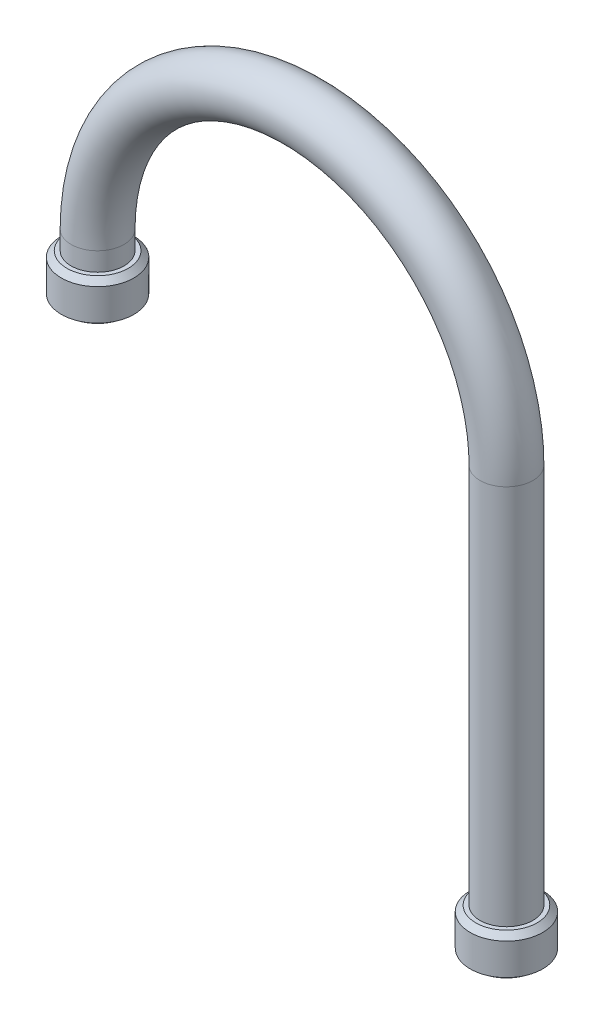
ISO-10303-21;
HEADER;
FILE_DESCRIPTION(('STEP AP214'),'2;1');
FILE_NAME('part.step','',(''),(''),'','','');
FILE_SCHEMA(('AUTOMOTIVE_DESIGN { 1 0 10303 214 1 1 1 1 }'));
ENDSEC;
DATA;
#1=APPLICATION_CONTEXT('core data for automotive mechanical design processes');
#2=APPLICATION_PROTOCOL_DEFINITION('international standard','automotive_design',2000,#1);
#3=PRODUCT_CONTEXT('',#1,'mechanical');
#4=PRODUCT('Part','Part','',(#3));
#5=PRODUCT_RELATED_PRODUCT_CATEGORY('part','',(#4));
#6=PRODUCT_DEFINITION_FORMATION('','',#4);
#7=PRODUCT_DEFINITION_CONTEXT('part definition',#1,'design');
#8=PRODUCT_DEFINITION('design','',#6,#7);
#9=PRODUCT_DEFINITION_SHAPE('','',#8);
#10=(LENGTH_UNIT() NAMED_UNIT(*) SI_UNIT(.MILLI.,.METRE.));
#11=(NAMED_UNIT(*) PLANE_ANGLE_UNIT() SI_UNIT($,.RADIAN.));
#12=(NAMED_UNIT(*) SI_UNIT($,.STERADIAN.) SOLID_ANGLE_UNIT());
#13=UNCERTAINTY_MEASURE_WITH_UNIT(LENGTH_MEASURE(1.E-05),#10,'distance_accuracy_value','');
#14=(GEOMETRIC_REPRESENTATION_CONTEXT(3) GLOBAL_UNCERTAINTY_ASSIGNED_CONTEXT((#13)) GLOBAL_UNIT_ASSIGNED_CONTEXT((#10,
#11,#12)) REPRESENTATION_CONTEXT('',''));
#15=CARTESIAN_POINT('',(0.,0.,0.));
#16=DIRECTION('',(0.,0.,1.));
#17=DIRECTION('',(1.,0.,0.));
#18=AXIS2_PLACEMENT_3D('',#15,#16,#17);
#19=CARTESIAN_POINT('',(0.,-2.,0.));
#20=DIRECTION('',(0.,-1.,0.));
#21=DIRECTION('',(0.,0.,-1.));
#22=AXIS2_PLACEMENT_3D('',#19,#20,#21);
#23=CYLINDRICAL_SURFACE('',#22,14.25);
#24=CARTESIAN_POINT('',(0.,20.,0.));
#25=DIRECTION('',(0.,-1.,0.));
#26=DIRECTION('',(0.,0.,-1.));
#27=AXIS2_PLACEMENT_3D('',#24,#25,#26);
#28=CIRCLE('',#27,14.25);
#29=CARTESIAN_POINT('',(0.,20.,-14.25));
#30=VERTEX_POINT('',#29);
#31=EDGE_CURVE('E26',#30,#30,#28,.T.);
#32=ORIENTED_EDGE('',*,*,#31,.F.);
#33=EDGE_LOOP('',(#32));
#34=FACE_BOUND('',#33,.T.);
#35=CARTESIAN_POINT('',(0.,30.,0.));
#36=DIRECTION('',(0.,-1.,0.));
#37=DIRECTION('',(0.,0.,-1.));
#38=AXIS2_PLACEMENT_3D('',#35,#36,#37);
#39=CIRCLE('',#38,14.25);
#40=CARTESIAN_POINT('',(0.,30.,-14.25));
#41=VERTEX_POINT('',#40);
#42=EDGE_CURVE('E10',#41,#41,#39,.T.);
#43=ORIENTED_EDGE('',*,*,#42,.T.);
#44=EDGE_LOOP('',(#43));
#45=FACE_BOUND('',#44,.T.);
#46=ADVANCED_FACE('F15',(#34,#45),#23,.T.);
#47=CARTESIAN_POINT('',(14.25,20.,0.));
#48=DIRECTION('',(0.,-1.,0.));
#49=DIRECTION('',(0.,0.,-1.));
#50=AXIS2_PLACEMENT_3D('',#47,#48,#49);
#51=PLANE('',#50);
#52=CARTESIAN_POINT('',(0.,20.,0.));
#53=DIRECTION('',(0.,-1.,0.));
#54=DIRECTION('',(0.,0.,-1.));
#55=AXIS2_PLACEMENT_3D('',#52,#53,#54);
#56=CIRCLE('',#55,16.5);
#57=CARTESIAN_POINT('',(0.,20.,-16.5));
#58=VERTEX_POINT('',#57);
#59=EDGE_CURVE('E113',#58,#58,#56,.T.);
#60=ORIENTED_EDGE('',*,*,#59,.F.);
#61=EDGE_LOOP('',(#60));
#62=FACE_BOUND('',#61,.T.);
#63=ORIENTED_EDGE('',*,*,#31,.T.);
#64=EDGE_LOOP('',(#63));
#65=FACE_BOUND('',#64,.T.);
#66=ADVANCED_FACE('F141',(#62,#65),#51,.F.);
#67=CARTESIAN_POINT('',(0.,20.,0.));
#68=DIRECTION('',(0.,-1.,0.));
#69=DIRECTION('',(0.,0.,-1.));
#70=AXIS2_PLACEMENT_3D('',#67,#68,#69);
#71=CONICAL_SURFACE('',#70,16.5,0.785398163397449);
#72=CARTESIAN_POINT('',(0.,17.,0.));
#73=DIRECTION('',(0.,-1.,0.));
#74=DIRECTION('',(0.,0.,-1.));
#75=AXIS2_PLACEMENT_3D('',#72,#73,#74);
#76=CIRCLE('',#75,19.5);
#77=CARTESIAN_POINT('',(0.,17.,-19.5));
#78=VERTEX_POINT('',#77);
#79=EDGE_CURVE('E111',#78,#78,#76,.T.);
#80=ORIENTED_EDGE('',*,*,#79,.F.);
#81=EDGE_LOOP('',(#80));
#82=FACE_BOUND('',#81,.T.);
#83=ORIENTED_EDGE('',*,*,#59,.T.);
#84=EDGE_LOOP('',(#83));
#85=FACE_BOUND('',#84,.T.);
#86=ADVANCED_FACE('F17',(#82,#85),#71,.T.);
#87=CARTESIAN_POINT('',(0.,-2.,0.));
#88=DIRECTION('',(0.,-1.,0.));
#89=DIRECTION('',(0.,0.,-1.));
#90=AXIS2_PLACEMENT_3D('',#87,#88,#89);
#91=CYLINDRICAL_SURFACE('',#90,19.5);
#92=CARTESIAN_POINT('',(0.,0.,0.));
#93=DIRECTION('',(0.,-1.,0.));
#94=DIRECTION('',(0.,0.,-1.));
#95=AXIS2_PLACEMENT_3D('',#92,#93,#94);
#96=CIRCLE('',#95,19.5);
#97=CARTESIAN_POINT('',(0.,0.,-19.5));
#98=VERTEX_POINT('',#97);
#99=EDGE_CURVE('E107',#98,#98,#96,.T.);
#100=ORIENTED_EDGE('',*,*,#99,.F.);
#101=EDGE_LOOP('',(#100));
#102=FACE_BOUND('',#101,.T.);
#103=ORIENTED_EDGE('',*,*,#79,.T.);
#104=EDGE_LOOP('',(#103));
#105=FACE_BOUND('',#104,.T.);
#106=ADVANCED_FACE('F151',(#102,#105),#91,.T.);
#107=CARTESIAN_POINT('',(19.5,0.,0.));
#108=DIRECTION('',(0.,1.,0.));
#109=DIRECTION('',(1.,0.,0.));
#110=AXIS2_PLACEMENT_3D('',#107,#108,#109);
#111=PLANE('',#110);
#112=CARTESIAN_POINT('',(0.,0.,0.));
#113=DIRECTION('',(0.,-1.,0.));
#114=DIRECTION('',(0.,0.,-1.));
#115=AXIS2_PLACEMENT_3D('',#112,#113,#114);
#116=CIRCLE('',#115,16.899);
#117=CARTESIAN_POINT('',(0.,0.,-16.899));
#118=VERTEX_POINT('',#117);
#119=EDGE_CURVE('E112',#118,#118,#116,.T.);
#120=ORIENTED_EDGE('',*,*,#119,.F.);
#121=EDGE_LOOP('',(#120));
#122=FACE_BOUND('',#121,.T.);
#123=ORIENTED_EDGE('',*,*,#99,.T.);
#124=EDGE_LOOP('',(#123));
#125=FACE_BOUND('',#124,.T.);
#126=ADVANCED_FACE('F163',(#122,#125),#111,.F.);
#127=CARTESIAN_POINT('',(0.,-2.,0.));
#128=DIRECTION('',(0.,-1.,0.));
#129=DIRECTION('',(0.,0.,-1.));
#130=AXIS2_PLACEMENT_3D('',#127,#128,#129);
#131=CYLINDRICAL_SURFACE('',#130,16.899);
#132=CARTESIAN_POINT('',(0.,-2.,0.));
#133=DIRECTION('',(0.,-1.,0.));
#134=DIRECTION('',(0.,0.,-1.));
#135=AXIS2_PLACEMENT_3D('',#132,#133,#134);
#136=CIRCLE('',#135,16.899);
#137=CARTESIAN_POINT('',(0.,-2.,-16.899));
#138=VERTEX_POINT('',#137);
#139=EDGE_CURVE('E120',#138,#138,#136,.T.);
#140=ORIENTED_EDGE('',*,*,#139,.F.);
#141=EDGE_LOOP('',(#140));
#142=FACE_BOUND('',#141,.T.);
#143=ORIENTED_EDGE('',*,*,#119,.T.);
#144=EDGE_LOOP('',(#143));
#145=FACE_BOUND('',#144,.T.);
#146=ADVANCED_FACE('F159',(#142,#145),#131,.T.);
#147=CARTESIAN_POINT('',(16.899,-2.,0.));
#148=DIRECTION('',(0.,1.,0.));
#149=DIRECTION('',(1.,0.,0.));
#150=AXIS2_PLACEMENT_3D('',#147,#148,#149);
#151=PLANE('',#150);
#152=ORIENTED_EDGE('',*,*,#139,.T.);
#153=EDGE_LOOP('',(#152));
#154=FACE_BOUND('',#153,.T.);
#155=ADVANCED_FACE('F162',(#154),#151,.F.);
#156=CARTESIAN_POINT('',(110.,30.,0.));
#157=DIRECTION('',(0.,0.,-1.));
#158=DIRECTION('',(-1.,0.,0.));
#159=AXIS2_PLACEMENT_3D('',#156,#157,#158);
#160=TOROIDAL_SURFACE('',#159,110.,14.25);
#161=ORIENTED_EDGE('',*,*,#42,.F.);
#162=EDGE_LOOP('',(#161));
#163=FACE_BOUND('',#162,.T.);
#164=CARTESIAN_POINT('',(220.,30.,0.));
#165=DIRECTION('',(0.,-1.,0.));
#166=DIRECTION('',(-1.,0.,0.));
#167=AXIS2_PLACEMENT_3D('',#164,#165,#166);
#168=CIRCLE('',#167,14.25);
#169=CARTESIAN_POINT('',(205.75,30.,0.));
#170=VERTEX_POINT('',#169);
#171=EDGE_CURVE('E95',#170,#170,#168,.T.);
#172=ORIENTED_EDGE('',*,*,#171,.F.);
#173=EDGE_LOOP('',(#172));
#174=FACE_BOUND('',#173,.T.);
#175=ADVANCED_FACE('F173',(#163,#174),#160,.T.);
#176=CARTESIAN_POINT('',(220.,-197.,0.));
#177=DIRECTION('',(0.,-1.,0.));
#178=DIRECTION('',(0.,0.,-1.));
#179=AXIS2_PLACEMENT_3D('',#176,#177,#178);
#180=CYLINDRICAL_SURFACE('',#179,14.25);
#181=CARTESIAN_POINT('',(220.,-175.,0.));
#182=DIRECTION('',(0.,-1.,0.));
#183=DIRECTION('',(0.,0.,-1.));
#184=AXIS2_PLACEMENT_3D('',#181,#182,#183);
#185=CIRCLE('',#184,14.25);
#186=CARTESIAN_POINT('',(220.,-175.,-14.25));
#187=VERTEX_POINT('',#186);
#188=EDGE_CURVE('E87',#187,#187,#185,.T.);
#189=ORIENTED_EDGE('',*,*,#188,.F.);
#190=EDGE_LOOP('',(#189));
#191=FACE_BOUND('',#190,.T.);
#192=ORIENTED_EDGE('',*,*,#171,.T.);
#193=EDGE_LOOP('',(#192));
#194=FACE_BOUND('',#193,.T.);
#195=ADVANCED_FACE('F157',(#191,#194),#180,.T.);
#196=CARTESIAN_POINT('',(234.25,-175.,0.));
#197=DIRECTION('',(0.,-1.,0.));
#198=DIRECTION('',(0.,0.,-1.));
#199=AXIS2_PLACEMENT_3D('',#196,#197,#198);
#200=PLANE('',#199);
#201=CARTESIAN_POINT('',(220.,-175.,0.));
#202=DIRECTION('',(0.,-1.,0.));
#203=DIRECTION('',(0.,0.,-1.));
#204=AXIS2_PLACEMENT_3D('',#201,#202,#203);
#205=CIRCLE('',#204,16.5);
#206=CARTESIAN_POINT('',(220.,-175.,-16.5));
#207=VERTEX_POINT('',#206);
#208=EDGE_CURVE('E19',#207,#207,#205,.T.);
#209=ORIENTED_EDGE('',*,*,#208,.F.);
#210=EDGE_LOOP('',(#209));
#211=FACE_BOUND('',#210,.T.);
#212=ORIENTED_EDGE('',*,*,#188,.T.);
#213=EDGE_LOOP('',(#212));
#214=FACE_BOUND('',#213,.T.);
#215=ADVANCED_FACE('F83',(#211,#214),#200,.F.);
#216=CARTESIAN_POINT('',(220.,-175.,0.));
#217=DIRECTION('',(0.,-1.,0.));
#218=DIRECTION('',(0.,0.,-1.));
#219=AXIS2_PLACEMENT_3D('',#216,#217,#218);
#220=CONICAL_SURFACE('',#219,16.5,0.785398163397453);
#221=CARTESIAN_POINT('',(220.,-178.,0.));
#222=DIRECTION('',(0.,-1.,0.));
#223=DIRECTION('',(0.,0.,-1.));
#224=AXIS2_PLACEMENT_3D('',#221,#222,#223);
#225=CIRCLE('',#224,19.5);
#226=CARTESIAN_POINT('',(220.,-178.,-19.5));
#227=VERTEX_POINT('',#226);
#228=EDGE_CURVE('E88',#227,#227,#225,.T.);
#229=ORIENTED_EDGE('',*,*,#228,.F.);
#230=EDGE_LOOP('',(#229));
#231=FACE_BOUND('',#230,.T.);
#232=ORIENTED_EDGE('',*,*,#208,.T.);
#233=EDGE_LOOP('',(#232));
#234=FACE_BOUND('',#233,.T.);
#235=ADVANCED_FACE('F181',(#231,#234),#220,.T.);
#236=CARTESIAN_POINT('',(220.,-197.,0.));
#237=DIRECTION('',(0.,-1.,0.));
#238=DIRECTION('',(0.,0.,-1.));
#239=AXIS2_PLACEMENT_3D('',#236,#237,#238);
#240=CYLINDRICAL_SURFACE('',#239,19.5);
#241=CARTESIAN_POINT('',(220.,-195.,0.));
#242=DIRECTION('',(0.,-1.,0.));
#243=DIRECTION('',(0.,0.,-1.));
#244=AXIS2_PLACEMENT_3D('',#241,#242,#243);
#245=CIRCLE('',#244,19.5);
#246=CARTESIAN_POINT('',(220.,-195.,-19.5));
#247=VERTEX_POINT('',#246);
#248=EDGE_CURVE('E98',#247,#247,#245,.T.);
#249=ORIENTED_EDGE('',*,*,#248,.F.);
#250=EDGE_LOOP('',(#249));
#251=FACE_BOUND('',#250,.T.);
#252=ORIENTED_EDGE('',*,*,#228,.T.);
#253=EDGE_LOOP('',(#252));
#254=FACE_BOUND('',#253,.T.);
#255=ADVANCED_FACE('F177',(#251,#254),#240,.T.);
#256=CARTESIAN_POINT('',(239.5,-195.,0.));
#257=DIRECTION('',(0.,1.,0.));
#258=DIRECTION('',(1.,0.,0.));
#259=AXIS2_PLACEMENT_3D('',#256,#257,#258);
#260=PLANE('',#259);
#261=CARTESIAN_POINT('',(220.,-195.,0.));
#262=DIRECTION('',(0.,-1.,0.));
#263=DIRECTION('',(0.,0.,-1.));
#264=AXIS2_PLACEMENT_3D('',#261,#262,#263);
#265=CIRCLE('',#264,16.899);
#266=CARTESIAN_POINT('',(220.,-195.,-16.899));
#267=VERTEX_POINT('',#266);
#268=EDGE_CURVE('E104',#267,#267,#265,.T.);
#269=ORIENTED_EDGE('',*,*,#268,.F.);
#270=EDGE_LOOP('',(#269));
#271=FACE_BOUND('',#270,.T.);
#272=ORIENTED_EDGE('',*,*,#248,.T.);
#273=EDGE_LOOP('',(#272));
#274=FACE_BOUND('',#273,.T.);
#275=ADVANCED_FACE('F180',(#271,#274),#260,.F.);
#276=CARTESIAN_POINT('',(220.,-197.,0.));
#277=DIRECTION('',(0.,-1.,0.));
#278=DIRECTION('',(0.,0.,-1.));
#279=AXIS2_PLACEMENT_3D('',#276,#277,#278);
#280=CYLINDRICAL_SURFACE('',#279,16.899);
#281=CARTESIAN_POINT('',(220.,-197.,0.));
#282=DIRECTION('',(0.,-1.,0.));
#283=DIRECTION('',(0.,0.,-1.));
#284=AXIS2_PLACEMENT_3D('',#281,#282,#283);
#285=CIRCLE('',#284,16.899);
#286=CARTESIAN_POINT('',(220.,-197.,-16.899));
#287=VERTEX_POINT('',#286);
#288=EDGE_CURVE('E127',#287,#287,#285,.T.);
#289=ORIENTED_EDGE('',*,*,#288,.F.);
#290=EDGE_LOOP('',(#289));
#291=FACE_BOUND('',#290,.T.);
#292=ORIENTED_EDGE('',*,*,#268,.T.);
#293=EDGE_LOOP('',(#292));
#294=FACE_BOUND('',#293,.T.);
#295=ADVANCED_FACE('F168',(#291,#294),#280,.T.);
#296=CARTESIAN_POINT('',(236.899,-197.,0.));
#297=DIRECTION('',(0.,1.,0.));
#298=DIRECTION('',(1.,0.,0.));
#299=AXIS2_PLACEMENT_3D('',#296,#297,#298);
#300=PLANE('',#299);
#301=ORIENTED_EDGE('',*,*,#288,.T.);
#302=EDGE_LOOP('',(#301));
#303=FACE_BOUND('',#302,.T.);
#304=ADVANCED_FACE('F165',(#303),#300,.F.);
#305=CLOSED_SHELL('',(#46,#66,#86,#106,#126,#146,#155,#175,#195,#215,#235,#255,#275,#295,#304));
#306=MANIFOLD_SOLID_BREP('B1',#305);
#307=ADVANCED_BREP_SHAPE_REPRESENTATION('',(#18,#306),#14);
#308=SHAPE_DEFINITION_REPRESENTATION(#9,#307);
ENDSEC;
END-ISO-10303-21;
